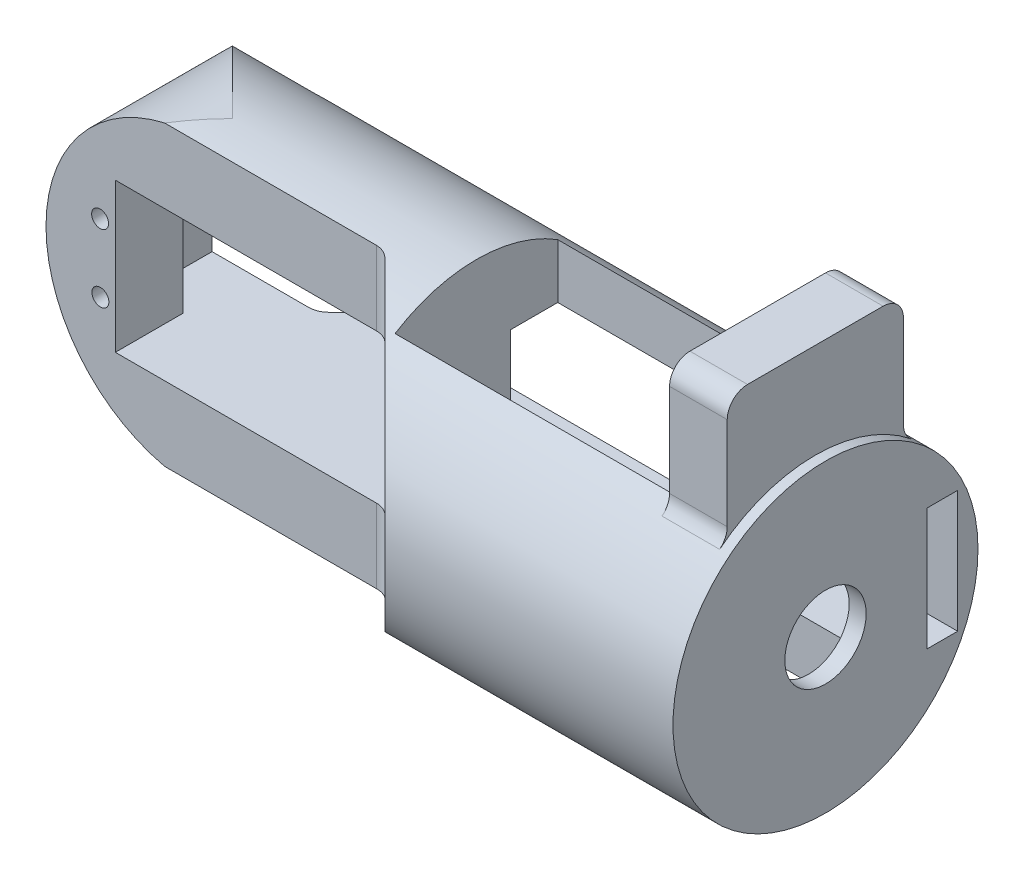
from build123d import *

# Parameters (mm, degrees)
SKETCH1_R                    = 22.5
BOSS_EXTRUDE1_DEPTH          = 110
CUT_EXTRUDE5_DEPTH           = 115.509824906
CUT_EXTRUDE5_DEPTH_BACK      = 115.509824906
SKETCH7_W                    = 49
SKETCH7_H                    = 24
CUT_EXTRUDE1_START           = 25
SKETCH2_W                    = 50
SKETCH2_H                    = 55
CUT_EXTRUDE1_DEPTH           = 20
CUT_EXTRUDE4_DEPTH           = 116.596280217
CUT_EXTRUDE4_DEPTH_BACK      = 116.596280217
CUT_EXTRUDE_THIN1_DEPTH      = 100.058063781
CUT_EXTRUDE_THIN1_DEPTH_BACK = 50
CUT_EXTRUDE_THIN1_START      = 50
SKETCH5_W                    = 43.874821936
SKETCH5_H                    = 20
CUT_EXTRUDE10_START          = -25
SKETCH12_W                   = 20
SKETCH12_H                   = 55
CUT_EXTRUDE10_DEPTH          = 10
SKETCH13_W                   = 33.752734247
SKETCH13_H                   = 50
CUT_EXTRUDE_THIN2_DEPTH      = 20
CUT_EXTRUDE11_START          = -25
SKETCH14_W                   = 55
SKETCH14_H                   = 22
CUT_EXTRUDE11_DEPTH          = 20
CUT_EXTRUDE12_REACH          = 117.596
SKETCH15_R                   = 6
BOSS_EXTRUDE2_START          = 9
BOSS_EXTRUDE2_DEPTH          = 7.5
BOSS_EXTRUDE3_START          = 1
BOSS_EXTRUDE3_DEPTH          = 1
CUT_EXTRUDE13_REACH          = 120.072
SKETCH19_R                   = 6
FILLET1_R                    = 3
FILLET2_R                    = 3
FILLET3_R                    = 3
M3_TAPPED_HOLE1_D            = 2.5
M3_TAPPED_HOLE1_DEPTH        = 12
M3_TAPPED_HOLE1_TIP          = 0.751075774
M3_TAPPED_HOLE2_D            = 2.5
M3_TAPPED_HOLE2_DEPTH        = 7.5
M3_TAPPED_HOLE2_TIP          = 0.751075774
SKETCH29_W                   = 4.5
SKETCH29_H                   = 18
CUT_EXTRUDE15_DEPTH          = 97
CUT_EXTRUDE16_START          = -45.5
CUT_EXTRUDE16_DEPTH          = 45.5
SKETCH31_W                   = 42.499639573
SKETCH31_H                   = 22
CUT_EXTRUDE17_DEPTH          = 120.125565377


with BuildPart() as part:
    # Sketch1 → Boss-Extrude1 (new body)
    with BuildSketch(Plane(origin=(0, 0, 0), x_dir=(0, 0, -1), z_dir=(1, 0, 0))):
        Circle(SKETCH1_R)
    extrude(amount=-BOSS_EXTRUDE1_DEPTH)

    # Sketch7 → Cut-Extrude5 (cut, two sides: drawn at the far end of the back side and taken through both)
    with BuildSketch(Plane(origin=(0, 0, 0), x_dir=(1, 0, 0), z_dir=(0, 1, 0)).offset(-CUT_EXTRUDE5_DEPTH_BACK)):
        with Locations((-27, 0)):
            Rectangle(SKETCH7_W, SKETCH7_H)
    extrude(amount=CUT_EXTRUDE5_DEPTH + CUT_EXTRUDE5_DEPTH_BACK, mode=Mode.SUBTRACT)

    # Sketch2 → Cut-Extrude1 (cut)
    with BuildSketch(Plane.XY.offset(CUT_EXTRUDE1_START)):
        with Locations((-85, 0)):
            Rectangle(SKETCH2_W, SKETCH2_H)
    extrude(amount=-CUT_EXTRUDE1_DEPTH, mode=Mode.SUBTRACT)

    # Sketch3 → Cut-Extrude4 (cut, two sides: drawn at the far end of the back side and taken through both)
    with BuildSketch(Plane.XY.offset(5).offset(-CUT_EXTRUDE4_DEPTH_BACK)):
        with BuildLine():
            Line((-92.5, 21.937410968), (-110, 21.937410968))
            Line((-110, 21.937410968), (-110, 0))
            ThreePointArc((-110, 0), (-105.089059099, 14.0312152), (-92.5, 21.937410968))
        make_face()
        with BuildLine():
            ThreePointArc((-92.5, -21.937410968), (-105.089059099, -14.0312152), (-110, 0))
            Line((-110, 0), (-110, -21.937410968))
            Line((-110, -21.937410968), (-92.5, -21.937410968))
        make_face()
        with BuildLine():
            Line((-92.5, -21.937410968), (-110, -21.937410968))
            Line((-110, -21.937410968), (-110, -22.5))
            Line((-110, -22.5), (-87.5, -22.5))
            ThreePointArc((-87.5, -22.5), (-90.015775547, -22.35891038), (-92.5, -21.937410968))
        make_face()
        with BuildLine():
            Line((-87.5, 22.5), (-110, 22.5))
            Line((-110, 22.5), (-110, 21.937410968))
            Line((-110, 21.937410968), (-92.5, 21.937410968))
            ThreePointArc((-92.5, 21.937410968), (-90.015775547, 22.35891038), (-87.5, 22.5))
        make_face()
    extrude(amount=CUT_EXTRUDE4_DEPTH + CUT_EXTRUDE4_DEPTH_BACK, mode=Mode.SUBTRACT)

    # Sketch5 → Cut-Extrude-Thin1 (cut, two sides: drawn at the far end of the back side and taken through both)
    with BuildSketch(Plane(origin=(-27.5, 0, -27.5), x_dir=(0, 1, 0), z_dir=(0.7071067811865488, 0, 0.7071067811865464)).offset(CUT_EXTRUDE_THIN1_START - CUT_EXTRUDE_THIN1_DEPTH_BACK)):
        with Locations((0, 55.961940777)):
            Rectangle(SKETCH5_W, SKETCH5_H)
    extrude(amount=CUT_EXTRUDE_THIN1_DEPTH + CUT_EXTRUDE_THIN1_DEPTH_BACK, mode=Mode.SUBTRACT)

    # Sketch12 → Cut-Extrude10 (cut)
    with BuildSketch(Plane.XY.offset(CUT_EXTRUDE10_START)):
        with Locations((-100, 0)):
            Rectangle(SKETCH12_W, SKETCH12_H)
    extrude(amount=CUT_EXTRUDE10_DEPTH, mode=Mode.SUBTRACT)

    # Sketch13 → Cut-Extrude-Thin2 (cut)
    with BuildSketch(Plane(origin=(-37.5, 0, 37.5), x_dir=(0, 1, 0), z_dir=(0.7071067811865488, 0, -0.7071067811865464))):
        with Locations((0.105857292, -99.246212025)):
            Rectangle(SKETCH13_W, SKETCH13_H)
    extrude(amount=CUT_EXTRUDE_THIN2_DEPTH, mode=Mode.SUBTRACT)

    # Sketch14 → Cut-Extrude11 (cut)
    with BuildSketch(Plane.XY.offset(CUT_EXTRUDE11_START)):
        with Locations((-78, 0)):
            Rectangle(SKETCH14_W, SKETCH14_H)
    extrude(amount=CUT_EXTRUDE11_DEPTH, mode=Mode.SUBTRACT)

    # Sketch15 → Cut-Extrude12 (cut, up to next)
    with BuildSketch(Plane.XY.offset(5), mode=Mode.PRIVATE) as cut_extrude12_sk1:
        with Locations((-87.5, 0)):
            Circle(SKETCH15_R)
    cut_extrude12_tool1 = extrude(cut_extrude12_sk1.sketch, amount=-CUT_EXTRUDE12_REACH, mode=Mode.PRIVATE) & part.part
    add(cut_extrude12_tool1.solids().sort_by_distance((-87.5, 0, 5))[0], mode=Mode.SUBTRACT)

    # Sketch16 → Boss-Extrude2 (add)
    with BuildSketch(Plane(origin=(-11.5, 0, 0), x_dir=(0, 0, -1), z_dir=(1, 0, 0)).offset(BOSS_EXTRUDE2_START)):
        with BuildLine():
            ThreePointArc((-13, 18.364367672), (-12.504468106, 18.705300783), (-12, 19.032866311))
            Line((-12, 19.032866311), (-12, 30.032866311))
            Line((-12, 30.032866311), (12, 30.032866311))
            Line((12, 30.032866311), (12, 19.032866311))
            ThreePointArc((12, 19.032866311), (12.504468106, 18.705300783), (13, 18.364367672))
            Line((13, 18.364367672), (13, 36.532866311))
            Line((13, 36.532866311), (-13, 36.532866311))
            Line((-13, 36.532866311), (-13, 30.032866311))
            Line((-13, 30.032866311), (-13, 19.032866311))
            Line((-13, 19.032866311), (-13, 18.364367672))
        make_face()
    extrude(amount=-BOSS_EXTRUDE2_DEPTH)

    # Sketch17 → Boss-Extrude3 (add)
    with BuildSketch(Plane(origin=(-2.5, 0, 0), x_dir=(0, 0, -1), z_dir=(1, 0, 0)).offset(BOSS_EXTRUDE3_START)):
        with BuildLine():
            Line((13, 36.532866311), (13, 18.364367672))
            ThreePointArc((13, 18.364367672), (0, 22.5), (-13, 18.364367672))
            Line((-13, 18.364367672), (-13, 36.532866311))
            Line((-13, 36.532866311), (13, 36.532866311))
        make_face()
    extrude(amount=-BOSS_EXTRUDE3_DEPTH)

    # Sketch19 → Cut-Extrude13 (cut, up to next)
    with BuildSketch(Plane(origin=(0, 0, 0), x_dir=(0, 0, -1), z_dir=(1, 0, 0)), mode=Mode.PRIVATE) as cut_extrude13_sk1:
        Circle(SKETCH19_R)
    cut_extrude13_tool1 = extrude(cut_extrude13_sk1.sketch, amount=-CUT_EXTRUDE13_REACH, mode=Mode.PRIVATE) & part.part
    add(cut_extrude13_tool1.solids().sort_by_distance((0, 0, 0))[0], mode=Mode.SUBTRACT)

    # Fillet1
    fillet1_edges = [part.edges().sort_by_distance(p)[0] for p in [
        (-60, 0, 5),
    ]]
    fillet(fillet1_edges, radius=FILLET1_R)

    # Fillet2
    fillet2_edges = [part.edges().sort_by_distance(p)[0] for p in [
        (-90, -13.885254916, -15),
        (-90, 13.885254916, -15),
    ]]
    fillet(fillet2_edges, radius=FILLET2_R)

    # Fillet3
    fillet3_edges = [part.edges().sort_by_distance(p)[0] for p in [
        (-5.75, 18.364367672, 13),
        (-5.75, 18.364367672, -13),
        (-5.75, 36.532866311, -13),
        (-5.75, 36.532866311, 13),
    ]]
    fillet(fillet3_edges, radius=FILLET3_R)

    # M3 Tapped Hole1
    with Locations(Plane(origin=(0, 0, -5), x_dir=(-1, 0, 0), z_dir=(0, 0, -1))):
        with Locations((55.019830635, 5.127240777), (54.980667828, -4.872682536), (102.019470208, 4.943175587), (101.980307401, -5.056747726)):
            Hole(M3_TAPPED_HOLE1_D / 2, depth=M3_TAPPED_HOLE1_DEPTH)
            with Locations((0, 0, -(M3_TAPPED_HOLE1_DEPTH + M3_TAPPED_HOLE1_TIP / 2))):  # 118° drill point
                Cone(0, M3_TAPPED_HOLE1_D / 2, M3_TAPPED_HOLE1_TIP, mode=Mode.SUBTRACT)

    # M3 Tapped Hole2
    with Locations(Plane.ZY.offset(10)):
        with Locations((-5, 32.5), (5, 32.5), (-5, -14.5), (5, -14.5)):
            Hole(M3_TAPPED_HOLE2_D / 2, depth=M3_TAPPED_HOLE2_DEPTH)
            with Locations((0, 0, -(M3_TAPPED_HOLE2_DEPTH + M3_TAPPED_HOLE2_TIP / 2))):  # 118° drill point
                Cone(0, M3_TAPPED_HOLE2_D / 2, M3_TAPPED_HOLE2_TIP, mode=Mode.SUBTRACT)

    # Sketch29 → Cut-Extrude15 (cut)
    with BuildSketch(Plane.ZY.offset(50.5)):
        with Locations((-17.25, 0)):
            Rectangle(SKETCH29_W, SKETCH29_H)
    extrude(amount=-CUT_EXTRUDE15_DEPTH, mode=Mode.SUBTRACT)

    # Sketch30 → Cut-Extrude16 (cut)
    with BuildSketch(Plane.ZY.offset(50.5).offset(CUT_EXTRUDE16_START)):
        with BuildLine():
            Line((-19.627786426, -11), (-12, -11))
            Line((-12, -11), (-12, 11))
            Line((-12, 11), (-19.627786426, 11))
            ThreePointArc((-19.627786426, 11), (-22.5, 0), (-19.627786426, -11))
        make_face()
    extrude(amount=CUT_EXTRUDE16_DEPTH, mode=Mode.SUBTRACT)

    # Sketch31 → Cut-Extrude17 (cut, through all)
    with BuildSketch(Plane(origin=(0, 0, -5), x_dir=(-1, 0, 0), z_dir=(0, 0, -1))):
        with Locations((78.519650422, 0)):
            Rectangle(SKETCH31_W, SKETCH31_H)
    extrude(amount=-CUT_EXTRUDE17_DEPTH, mode=Mode.SUBTRACT)


solid = part.part
